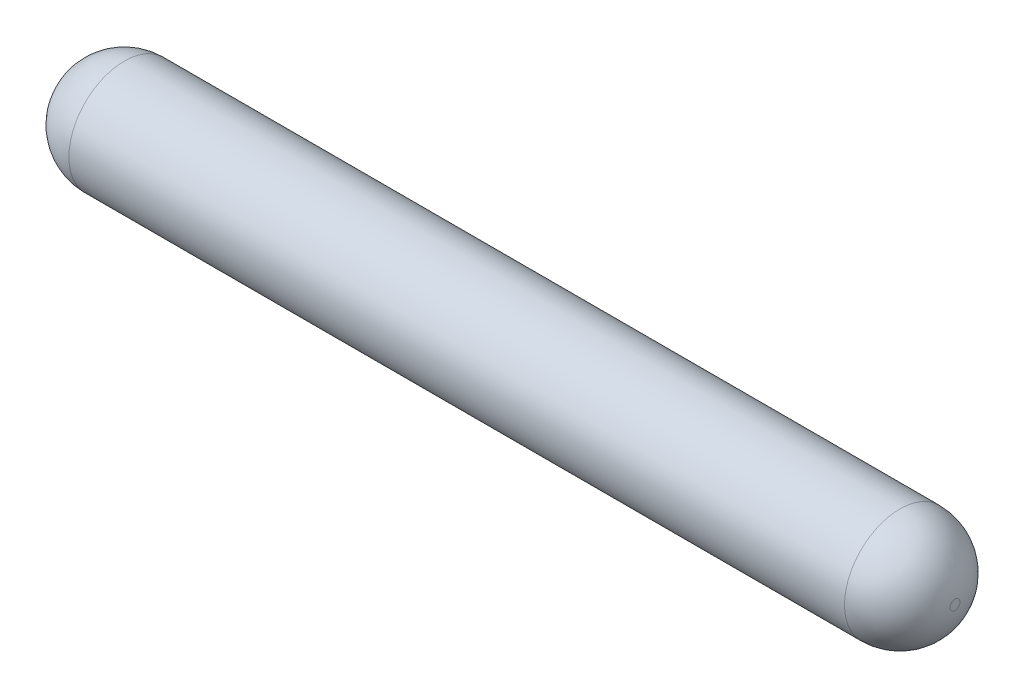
ISO-10303-21;
HEADER;
FILE_DESCRIPTION(('STEP AP214'),'2;1');
FILE_NAME('part.step','',(''),(''),'','','');
FILE_SCHEMA(('AUTOMOTIVE_DESIGN { 1 0 10303 214 1 1 1 1 }'));
ENDSEC;
DATA;
#1=APPLICATION_CONTEXT('core data for automotive mechanical design processes');
#2=APPLICATION_PROTOCOL_DEFINITION('international standard','automotive_design',2000,#1);
#3=PRODUCT_CONTEXT('',#1,'mechanical');
#4=PRODUCT('Part','Part','',(#3));
#5=PRODUCT_RELATED_PRODUCT_CATEGORY('part','',(#4));
#6=PRODUCT_DEFINITION_FORMATION('','',#4);
#7=PRODUCT_DEFINITION_CONTEXT('part definition',#1,'design');
#8=PRODUCT_DEFINITION('design','',#6,#7);
#9=PRODUCT_DEFINITION_SHAPE('','',#8);
#10=(LENGTH_UNIT() NAMED_UNIT(*) SI_UNIT(.MILLI.,.METRE.));
#11=(NAMED_UNIT(*) PLANE_ANGLE_UNIT() SI_UNIT($,.RADIAN.));
#12=(NAMED_UNIT(*) SI_UNIT($,.STERADIAN.) SOLID_ANGLE_UNIT());
#13=UNCERTAINTY_MEASURE_WITH_UNIT(LENGTH_MEASURE(1.E-05),#10,'distance_accuracy_value','');
#14=(GEOMETRIC_REPRESENTATION_CONTEXT(3) GLOBAL_UNCERTAINTY_ASSIGNED_CONTEXT((#13)) GLOBAL_UNIT_ASSIGNED_CONTEXT((#10,
#11,#12)) REPRESENTATION_CONTEXT('',''));
#15=CARTESIAN_POINT('',(0.,0.,0.));
#16=DIRECTION('',(0.,0.,1.));
#17=DIRECTION('',(1.,0.,0.));
#18=AXIS2_PLACEMENT_3D('',#15,#16,#17);
#19=CARTESIAN_POINT('',(0.01,0.,0.));
#20=DIRECTION('',(1.,0.,0.));
#21=DIRECTION('',(0.,0.,-1.));
#22=AXIS2_PLACEMENT_3D('',#19,#20,#21);
#23=PLANE('',#22);
#24=CARTESIAN_POINT('',(0.01,0.,0.));
#25=DIRECTION('',(-1.,0.,0.));
#26=DIRECTION('',(0.,0.,1.));
#27=AXIS2_PLACEMENT_3D('',#24,#25,#26);
#28=CIRCLE('',#27,0.223383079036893);
#29=CARTESIAN_POINT('',(0.01,0.,0.223383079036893));
#30=VERTEX_POINT('',#29);
#31=EDGE_CURVE('E42',#30,#30,#28,.T.);
#32=ORIENTED_EDGE('',*,*,#31,.T.);
#33=EDGE_LOOP('',(#32));
#34=FACE_BOUND('',#33,.T.);
#35=ADVANCED_FACE('F28',(#34),#23,.F.);
#36=CARTESIAN_POINT('',(40.,0.,0.));
#37=DIRECTION('',(-1.,0.,0.));
#38=DIRECTION('',(0.,0.,1.));
#39=AXIS2_PLACEMENT_3D('',#36,#37,#38);
#40=PLANE('',#39);
#41=CARTESIAN_POINT('',(40.,0.,0.));
#42=DIRECTION('',(-1.,0.,0.));
#43=DIRECTION('',(0.,0.,1.));
#44=AXIS2_PLACEMENT_3D('',#41,#42,#43);
#45=CIRCLE('',#44,0.223383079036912);
#46=CARTESIAN_POINT('',(40.,0.,0.223383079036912));
#47=VERTEX_POINT('',#46);
#48=EDGE_CURVE('E10',#47,#47,#45,.T.);
#49=ORIENTED_EDGE('',*,*,#48,.F.);
#50=EDGE_LOOP('',(#49));
#51=FACE_BOUND('',#50,.T.);
#52=ADVANCED_FACE('F62',(#51),#40,.F.);
#53=CARTESIAN_POINT('',(37.51,0.,0.));
#54=DIRECTION('',(-1.,0.,0.));
#55=DIRECTION('',(0.,0.,-1.));
#56=AXIS2_PLACEMENT_3D('',#53,#54,#55);
#57=SPHERICAL_SURFACE('',#56,2.5);
#58=CARTESIAN_POINT('',(37.51,0.,0.));
#59=DIRECTION('',(-1.,0.,0.));
#60=DIRECTION('',(0.,0.,1.));
#61=AXIS2_PLACEMENT_3D('',#58,#59,#60);
#62=CIRCLE('',#61,2.5);
#63=CARTESIAN_POINT('',(37.51,0.,2.5));
#64=VERTEX_POINT('',#63);
#65=EDGE_CURVE('E34',#64,#64,#62,.T.);
#66=ORIENTED_EDGE('',*,*,#65,.F.);
#67=EDGE_LOOP('',(#66));
#68=FACE_BOUND('',#67,.T.);
#69=ORIENTED_EDGE('',*,*,#48,.T.);
#70=EDGE_LOOP('',(#69));
#71=FACE_BOUND('',#70,.T.);
#72=ADVANCED_FACE('F57',(#68,#71),#57,.T.);
#73=CARTESIAN_POINT('',(0.01,0.,0.));
#74=DIRECTION('',(-1.,0.,0.));
#75=DIRECTION('',(0.,0.,1.));
#76=AXIS2_PLACEMENT_3D('',#73,#74,#75);
#77=CYLINDRICAL_SURFACE('',#76,2.5);
#78=CARTESIAN_POINT('',(2.5,0.,0.));
#79=DIRECTION('',(-1.,0.,0.));
#80=DIRECTION('',(0.,0.,1.));
#81=AXIS2_PLACEMENT_3D('',#78,#79,#80);
#82=CIRCLE('',#81,2.5);
#83=CARTESIAN_POINT('',(2.5,0.,2.5));
#84=VERTEX_POINT('',#83);
#85=EDGE_CURVE('E38',#84,#84,#82,.T.);
#86=ORIENTED_EDGE('',*,*,#85,.F.);
#87=EDGE_LOOP('',(#86));
#88=FACE_BOUND('',#87,.T.);
#89=ORIENTED_EDGE('',*,*,#65,.T.);
#90=EDGE_LOOP('',(#89));
#91=FACE_BOUND('',#90,.T.);
#92=ADVANCED_FACE('F52',(#88,#91),#77,.T.);
#93=CARTESIAN_POINT('',(2.5,0.,0.));
#94=DIRECTION('',(-1.,0.,0.));
#95=DIRECTION('',(0.,0.,-1.));
#96=AXIS2_PLACEMENT_3D('',#93,#94,#95);
#97=SPHERICAL_SURFACE('',#96,2.5);
#98=ORIENTED_EDGE('',*,*,#31,.F.);
#99=EDGE_LOOP('',(#98));
#100=FACE_BOUND('',#99,.T.);
#101=ORIENTED_EDGE('',*,*,#85,.T.);
#102=EDGE_LOOP('',(#101));
#103=FACE_BOUND('',#102,.T.);
#104=ADVANCED_FACE('F49',(#100,#103),#97,.T.);
#105=CLOSED_SHELL('',(#35,#52,#72,#92,#104));
#106=MANIFOLD_SOLID_BREP('B2',#105);
#107=ADVANCED_BREP_SHAPE_REPRESENTATION('',(#18,#106),#14);
#108=SHAPE_DEFINITION_REPRESENTATION(#9,#107);
ENDSEC;
END-ISO-10303-21;
